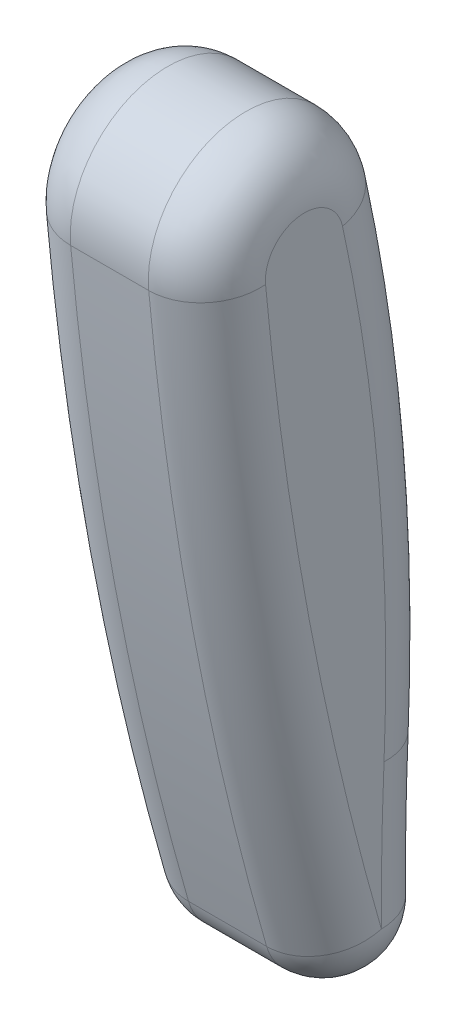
from build123d import *

# Parameters (mm, degrees)
BASE_EXTRUDE_DEPTH = 63.5
FILLET1_R          = 38.1


with BuildPart() as part:
    # Sketch7 → Base-Extrude (new, symmetric)
    with BuildSketch(Plane(origin=(114.3, 0, 0), x_dir=(0, 0, -1), z_dir=(1, 0, 0))):
        with BuildLine():
            ThreePointArc((37.885471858, -742.213802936), (-33.838948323, -692.9538134), (-87.396251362, -761.528986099))
            ThreePointArc((-87.396251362, -761.528986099), (-58.651901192, -967.339401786), (-10.701792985, -1169.539678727))
            ThreePointArc((-10.701792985, -1169.539678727), (31.347433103, -1196.725838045), (64.014969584, -1158.777758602))
            ThreePointArc((64.014969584, -1158.777758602), (64.297743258, -1113.02154154), (65.715717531, -1067.286426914))
            ThreePointArc((65.715717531, -1067.286426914), (62.282866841, -903.852702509), (37.885471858, -742.213802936))
        make_face()
    extrude(amount=BASE_EXTRUDE_DEPTH, both=True)

    # Fillet1
    fillet1_edges = [part.edges().sort_by_distance(p)[0] for p in [
        (177.8, -1113.02154154, -64.297743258),
        (177.8, -903.852702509, -62.282866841),
        (177.8, -692.9538134, 33.838948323),
        (177.8, -967.339401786, 58.651901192),
        (50.8, -692.9538134, 33.838948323),
        (50.8, -903.852702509, -62.282866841),
        (50.8, -1113.02154154, -64.297743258),
        (50.8, -1196.725838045, -31.347433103),
        (50.8, -967.339401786, 58.651901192),
        (177.8, -1196.725838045, -31.347433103),
    ]]
    fillet(fillet1_edges, radius=FILLET1_R)


solid = part.part
